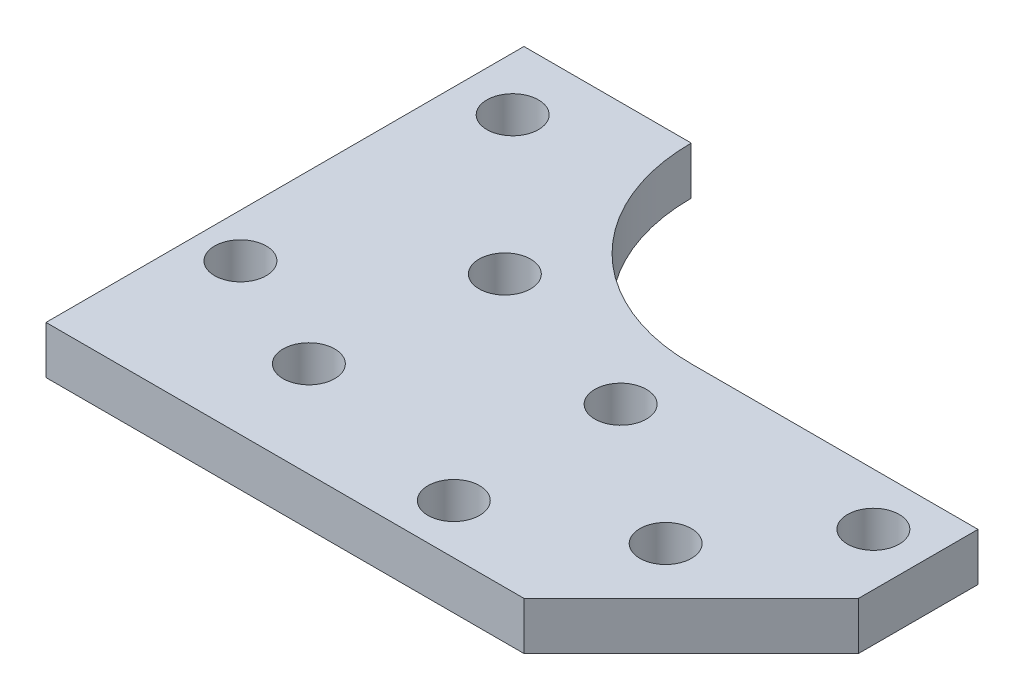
ISO-10303-21;
HEADER;
FILE_DESCRIPTION(('STEP AP214'),'2;1');
FILE_NAME('part.step','',(''),(''),'','','');
FILE_SCHEMA(('AUTOMOTIVE_DESIGN { 1 0 10303 214 1 1 1 1 }'));
ENDSEC;
DATA;
#1=APPLICATION_CONTEXT('core data for automotive mechanical design processes');
#2=APPLICATION_PROTOCOL_DEFINITION('international standard','automotive_design',2000,#1);
#3=PRODUCT_CONTEXT('',#1,'mechanical');
#4=PRODUCT('Part','Part','',(#3));
#5=PRODUCT_RELATED_PRODUCT_CATEGORY('part','',(#4));
#6=PRODUCT_DEFINITION_FORMATION('','',#4);
#7=PRODUCT_DEFINITION_CONTEXT('part definition',#1,'design');
#8=PRODUCT_DEFINITION('design','',#6,#7);
#9=PRODUCT_DEFINITION_SHAPE('','',#8);
#10=(LENGTH_UNIT() NAMED_UNIT(*) SI_UNIT(.MILLI.,.METRE.));
#11=(NAMED_UNIT(*) PLANE_ANGLE_UNIT() SI_UNIT($,.RADIAN.));
#12=(NAMED_UNIT(*) SI_UNIT($,.STERADIAN.) SOLID_ANGLE_UNIT());
#13=UNCERTAINTY_MEASURE_WITH_UNIT(LENGTH_MEASURE(1.E-05),#10,'distance_accuracy_value','');
#14=(GEOMETRIC_REPRESENTATION_CONTEXT(3) GLOBAL_UNCERTAINTY_ASSIGNED_CONTEXT((#13)) GLOBAL_UNIT_ASSIGNED_CONTEXT((#10,
#11,#12)) REPRESENTATION_CONTEXT('',''));
#15=CARTESIAN_POINT('',(0.,0.,0.));
#16=DIRECTION('',(0.,0.,1.));
#17=DIRECTION('',(1.,0.,0.));
#18=AXIS2_PLACEMENT_3D('',#15,#16,#17);
#19=CARTESIAN_POINT('',(75.,0.,-100.));
#20=DIRECTION('',(0.,-1.,0.));
#21=DIRECTION('',(0.,0.,-1.));
#22=AXIS2_PLACEMENT_3D('',#19,#20,#21);
#23=PLANE('',#22);
#24=CARTESIAN_POINT('',(11.1915887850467,0.,-86.4485981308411));
#25=DIRECTION('',(0.,1.,0.));
#26=DIRECTION('',(0.,0.,1.));
#27=AXIS2_PLACEMENT_3D('',#24,#25,#26);
#28=CIRCLE('',#27,5.39999999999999);
#29=CARTESIAN_POINT('',(11.1915887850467,0.,-81.0485981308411));
#30=VERTEX_POINT('',#29);
#31=EDGE_CURVE('E226',#30,#30,#28,.T.);
#32=ORIENTED_EDGE('',*,*,#31,.T.);
#33=EDGE_LOOP('',(#32));
#34=FACE_BOUND('',#33,.T.);
#35=CARTESIAN_POINT('',(104.883177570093,0.,-24.766355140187));
#36=DIRECTION('',(0.,1.,0.));
#37=DIRECTION('',(0.,0.,1.));
#38=AXIS2_PLACEMENT_3D('',#35,#36,#37);
#39=CIRCLE('',#38,5.39999999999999);
#40=CARTESIAN_POINT('',(104.883177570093,0.,-19.366355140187));
#41=VERTEX_POINT('',#40);
#42=EDGE_CURVE('E240',#41,#41,#39,.T.);
#43=ORIENTED_EDGE('',*,*,#42,.T.);
#44=EDGE_LOOP('',(#43));
#45=FACE_BOUND('',#44,.T.);
#46=CARTESIAN_POINT('',(74.9366219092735,0.,-10.3861239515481));
#47=DIRECTION('',(0.,1.,0.));
#48=DIRECTION('',(0.,0.,1.));
#49=AXIS2_PLACEMENT_3D('',#46,#47,#48);
#50=CIRCLE('',#49,5.39999999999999);
#51=CARTESIAN_POINT('',(74.9366219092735,0.,-4.98612395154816));
#52=VERTEX_POINT('',#51);
#53=EDGE_CURVE('E252',#52,#52,#50,.T.);
#54=ORIENTED_EDGE('',*,*,#53,.T.);
#55=EDGE_LOOP('',(#54));
#56=FACE_BOUND('',#55,.T.);
#57=CARTESIAN_POINT('',(35.,0.,-20.));
#58=DIRECTION('',(0.,1.,0.));
#59=DIRECTION('',(0.,0.,1.));
#60=AXIS2_PLACEMENT_3D('',#57,#58,#59);
#61=CIRCLE('',#60,5.39999999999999);
#62=CARTESIAN_POINT('',(35.,0.,-14.6));
#63=VERTEX_POINT('',#62);
#64=EDGE_CURVE('E113',#63,#63,#61,.T.);
#65=ORIENTED_EDGE('',*,*,#64,.T.);
#66=EDGE_LOOP('',(#65));
#67=FACE_BOUND('',#66,.T.);
#68=DIRECTION('',(0.,0.,1.));
#69=VECTOR('',#68,1.);
#70=CARTESIAN_POINT('',(0.,0.,-100.));
#71=LINE('',#70,#69);
#72=CARTESIAN_POINT('',(0.,0.,-100.));
#73=VERTEX_POINT('',#72);
#74=CARTESIAN_POINT('',(0.,0.,0.));
#75=VERTEX_POINT('',#74);
#76=EDGE_CURVE('E96',#73,#75,#71,.T.);
#77=ORIENTED_EDGE('',*,*,#76,.F.);
#78=DIRECTION('',(-1.,0.,0.));
#79=VECTOR('',#78,1.);
#80=CARTESIAN_POINT('',(35.,0.,-100.));
#81=LINE('',#80,#79);
#82=CARTESIAN_POINT('',(35.,0.,-100.));
#83=VERTEX_POINT('',#82);
#84=EDGE_CURVE('E124',#83,#73,#81,.T.);
#85=ORIENTED_EDGE('',*,*,#84,.F.);
#86=CARTESIAN_POINT('',(75.,0.,-100.));
#87=DIRECTION('',(0.,-1.,0.));
#88=DIRECTION('',(0.,0.,-1.));
#89=AXIS2_PLACEMENT_3D('',#86,#87,#88);
#90=CIRCLE('',#89,40.);
#91=CARTESIAN_POINT('',(75.,0.,-60.));
#92=VERTEX_POINT('',#91);
#93=EDGE_CURVE('E122',#92,#83,#90,.T.);
#94=ORIENTED_EDGE('',*,*,#93,.F.);
#95=DIRECTION('',(-1.,0.,0.));
#96=VECTOR('',#95,1.);
#97=CARTESIAN_POINT('',(135.,0.,-60.));
#98=LINE('',#97,#96);
#99=CARTESIAN_POINT('',(135.,0.,-60.));
#100=VERTEX_POINT('',#99);
#101=EDGE_CURVE('E120',#100,#92,#98,.T.);
#102=ORIENTED_EDGE('',*,*,#101,.F.);
#103=DIRECTION('',(0.,0.,-1.));
#104=VECTOR('',#103,1.);
#105=CARTESIAN_POINT('',(135.,0.,-35.));
#106=LINE('',#105,#104);
#107=CARTESIAN_POINT('',(135.,0.,-35.));
#108=VERTEX_POINT('',#107);
#109=EDGE_CURVE('E118',#108,#100,#106,.T.);
#110=ORIENTED_EDGE('',*,*,#109,.F.);
#111=DIRECTION('',(0.707106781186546,0.,-0.707106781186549));
#112=VECTOR('',#111,1.);
#113=CARTESIAN_POINT('',(100.,0.,0.));
#114=LINE('',#113,#112);
#115=CARTESIAN_POINT('',(100.,0.,0.));
#116=VERTEX_POINT('',#115);
#117=EDGE_CURVE('E98',#116,#108,#114,.T.);
#118=ORIENTED_EDGE('',*,*,#117,.F.);
#119=DIRECTION('',(1.,0.,0.));
#120=VECTOR('',#119,1.);
#121=CARTESIAN_POINT('',(0.,0.,0.));
#122=LINE('',#121,#120);
#123=EDGE_CURVE('E92',#75,#116,#122,.T.);
#124=ORIENTED_EDGE('',*,*,#123,.F.);
#125=EDGE_LOOP('',(#77,#85,#94,#102,#110,#118,#124));
#126=FACE_BOUND('',#125,.T.);
#127=CARTESIAN_POINT('',(9.1822429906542,0.,-31.4953271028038));
#128=DIRECTION('',(0.,1.,0.));
#129=DIRECTION('',(0.,0.,1.));
#130=AXIS2_PLACEMENT_3D('',#127,#128,#129);
#131=CIRCLE('',#130,5.39999999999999);
#132=CARTESIAN_POINT('',(9.1822429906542,0.,-26.0953271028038));
#133=VERTEX_POINT('',#132);
#134=EDGE_CURVE('E258',#133,#133,#131,.T.);
#135=ORIENTED_EDGE('',*,*,#134,.T.);
#136=EDGE_LOOP('',(#135));
#137=FACE_BOUND('',#136,.T.);
#138=CARTESIAN_POINT('',(39.2289719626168,0.,-56.7757009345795));
#139=DIRECTION('',(0.,1.,0.));
#140=DIRECTION('',(0.,0.,1.));
#141=AXIS2_PLACEMENT_3D('',#138,#139,#140);
#142=CIRCLE('',#141,5.39999999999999);
#143=CARTESIAN_POINT('',(39.2289719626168,0.,-51.3757009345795));
#144=VERTEX_POINT('',#143);
#145=EDGE_CURVE('E246',#144,#144,#142,.T.);
#146=ORIENTED_EDGE('',*,*,#145,.T.);
#147=EDGE_LOOP('',(#146));
#148=FACE_BOUND('',#147,.T.);
#149=CARTESIAN_POINT('',(124.042056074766,0.,-49.0654205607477));
#150=DIRECTION('',(0.,1.,0.));
#151=DIRECTION('',(0.,0.,1.));
#152=AXIS2_PLACEMENT_3D('',#149,#150,#151);
#153=CIRCLE('',#152,5.39999999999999);
#154=CARTESIAN_POINT('',(124.042056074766,0.,-43.6654205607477));
#155=VERTEX_POINT('',#154);
#156=EDGE_CURVE('E234',#155,#155,#153,.T.);
#157=ORIENTED_EDGE('',*,*,#156,.T.);
#158=EDGE_LOOP('',(#157));
#159=FACE_BOUND('',#158,.T.);
#160=CARTESIAN_POINT('',(74.9366219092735,0.,-45.2921588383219));
#161=DIRECTION('',(0.,1.,0.));
#162=DIRECTION('',(0.,0.,1.));
#163=AXIS2_PLACEMENT_3D('',#160,#161,#162);
#164=CIRCLE('',#163,5.39999999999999);
#165=CARTESIAN_POINT('',(74.9366219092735,0.,-39.8921588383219));
#166=VERTEX_POINT('',#165);
#167=EDGE_CURVE('E222',#166,#166,#164,.T.);
#168=ORIENTED_EDGE('',*,*,#167,.T.);
#169=EDGE_LOOP('',(#168));
#170=FACE_BOUND('',#169,.T.);
#171=ADVANCED_FACE('F33',(#34,#45,#56,#67,#126,#137,#148,#159,#170),#23,.T.);
#172=CARTESIAN_POINT('',(0.,10.,-100.));
#173=DIRECTION('',(1.,0.,0.));
#174=DIRECTION('',(0.,0.,-1.));
#175=AXIS2_PLACEMENT_3D('',#172,#173,#174);
#176=PLANE('',#175);
#177=ORIENTED_EDGE('',*,*,#76,.T.);
#178=DIRECTION('',(0.,-1.,0.));
#179=VECTOR('',#178,1.);
#180=CARTESIAN_POINT('',(0.,10.,0.));
#181=LINE('',#180,#179);
#182=CARTESIAN_POINT('',(0.,10.,0.));
#183=VERTEX_POINT('',#182);
#184=EDGE_CURVE('E11',#183,#75,#181,.T.);
#185=ORIENTED_EDGE('',*,*,#184,.F.);
#186=DIRECTION('',(0.,0.,1.));
#187=VECTOR('',#186,1.);
#188=CARTESIAN_POINT('',(0.,10.,-100.));
#189=LINE('',#188,#187);
#190=CARTESIAN_POINT('',(0.,10.,-100.));
#191=VERTEX_POINT('',#190);
#192=EDGE_CURVE('E126',#191,#183,#189,.T.);
#193=ORIENTED_EDGE('',*,*,#192,.F.);
#194=DIRECTION('',(0.,-1.,0.));
#195=VECTOR('',#194,1.);
#196=CARTESIAN_POINT('',(0.,10.,-100.));
#197=LINE('',#196,#195);
#198=EDGE_CURVE('E109',#191,#73,#197,.T.);
#199=ORIENTED_EDGE('',*,*,#198,.T.);
#200=EDGE_LOOP('',(#177,#185,#193,#199));
#201=FACE_BOUND('',#200,.T.);
#202=ADVANCED_FACE('F35',(#201),#176,.F.);
#203=CARTESIAN_POINT('',(0.,10.,0.));
#204=DIRECTION('',(0.,0.,-1.));
#205=DIRECTION('',(-1.,0.,0.));
#206=AXIS2_PLACEMENT_3D('',#203,#204,#205);
#207=PLANE('',#206);
#208=ORIENTED_EDGE('',*,*,#123,.T.);
#209=DIRECTION('',(0.,-1.,0.));
#210=VECTOR('',#209,1.);
#211=CARTESIAN_POINT('',(100.,10.,0.));
#212=LINE('',#211,#210);
#213=CARTESIAN_POINT('',(100.,10.,0.));
#214=VERTEX_POINT('',#213);
#215=EDGE_CURVE('E41',#214,#116,#212,.T.);
#216=ORIENTED_EDGE('',*,*,#215,.F.);
#217=DIRECTION('',(1.,0.,0.));
#218=VECTOR('',#217,1.);
#219=CARTESIAN_POINT('',(0.,10.,0.));
#220=LINE('',#219,#218);
#221=EDGE_CURVE('E105',#183,#214,#220,.T.);
#222=ORIENTED_EDGE('',*,*,#221,.F.);
#223=ORIENTED_EDGE('',*,*,#184,.T.);
#224=EDGE_LOOP('',(#208,#216,#222,#223));
#225=FACE_BOUND('',#224,.T.);
#226=ADVANCED_FACE('F104',(#225),#207,.F.);
#227=CARTESIAN_POINT('',(100.,10.,0.));
#228=DIRECTION('',(-0.707106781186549,0.,-0.707106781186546));
#229=DIRECTION('',(-0.707106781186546,0.,0.707106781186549));
#230=AXIS2_PLACEMENT_3D('',#227,#228,#229);
#231=PLANE('',#230);
#232=ORIENTED_EDGE('',*,*,#117,.T.);
#233=DIRECTION('',(0.,-1.,0.));
#234=VECTOR('',#233,1.);
#235=CARTESIAN_POINT('',(135.,10.,-35.));
#236=LINE('',#235,#234);
#237=CARTESIAN_POINT('',(135.,10.,-35.));
#238=VERTEX_POINT('',#237);
#239=EDGE_CURVE('E147',#238,#108,#236,.T.);
#240=ORIENTED_EDGE('',*,*,#239,.F.);
#241=DIRECTION('',(0.707106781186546,0.,-0.707106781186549));
#242=VECTOR('',#241,1.);
#243=CARTESIAN_POINT('',(100.,10.,0.));
#244=LINE('',#243,#242);
#245=EDGE_CURVE('E129',#214,#238,#244,.T.);
#246=ORIENTED_EDGE('',*,*,#245,.F.);
#247=ORIENTED_EDGE('',*,*,#215,.T.);
#248=EDGE_LOOP('',(#232,#240,#246,#247));
#249=FACE_BOUND('',#248,.T.);
#250=ADVANCED_FACE('F151',(#249),#231,.F.);
#251=CARTESIAN_POINT('',(135.,10.,-35.));
#252=DIRECTION('',(-1.,0.,0.));
#253=DIRECTION('',(0.,0.,1.));
#254=AXIS2_PLACEMENT_3D('',#251,#252,#253);
#255=PLANE('',#254);
#256=ORIENTED_EDGE('',*,*,#109,.T.);
#257=DIRECTION('',(0.,-1.,0.));
#258=VECTOR('',#257,1.);
#259=CARTESIAN_POINT('',(135.,10.,-60.));
#260=LINE('',#259,#258);
#261=CARTESIAN_POINT('',(135.,10.,-60.));
#262=VERTEX_POINT('',#261);
#263=EDGE_CURVE('E144',#262,#100,#260,.T.);
#264=ORIENTED_EDGE('',*,*,#263,.F.);
#265=DIRECTION('',(0.,0.,-1.));
#266=VECTOR('',#265,1.);
#267=CARTESIAN_POINT('',(135.,10.,-35.));
#268=LINE('',#267,#266);
#269=EDGE_CURVE('E131',#238,#262,#268,.T.);
#270=ORIENTED_EDGE('',*,*,#269,.F.);
#271=ORIENTED_EDGE('',*,*,#239,.T.);
#272=EDGE_LOOP('',(#256,#264,#270,#271));
#273=FACE_BOUND('',#272,.T.);
#274=ADVANCED_FACE('F159',(#273),#255,.F.);
#275=CARTESIAN_POINT('',(135.,10.,-60.));
#276=DIRECTION('',(0.,0.,1.));
#277=DIRECTION('',(1.,0.,0.));
#278=AXIS2_PLACEMENT_3D('',#275,#276,#277);
#279=PLANE('',#278);
#280=ORIENTED_EDGE('',*,*,#101,.T.);
#281=DIRECTION('',(0.,-1.,0.));
#282=VECTOR('',#281,1.);
#283=CARTESIAN_POINT('',(75.,10.,-60.));
#284=LINE('',#283,#282);
#285=CARTESIAN_POINT('',(75.,10.,-60.));
#286=VERTEX_POINT('',#285);
#287=EDGE_CURVE('E141',#286,#92,#284,.T.);
#288=ORIENTED_EDGE('',*,*,#287,.F.);
#289=DIRECTION('',(-1.,0.,0.));
#290=VECTOR('',#289,1.);
#291=CARTESIAN_POINT('',(135.,10.,-60.));
#292=LINE('',#291,#290);
#293=EDGE_CURVE('E133',#262,#286,#292,.T.);
#294=ORIENTED_EDGE('',*,*,#293,.F.);
#295=ORIENTED_EDGE('',*,*,#263,.T.);
#296=EDGE_LOOP('',(#280,#288,#294,#295));
#297=FACE_BOUND('',#296,.T.);
#298=ADVANCED_FACE('F162',(#297),#279,.F.);
#299=CARTESIAN_POINT('',(75.,10.,-100.));
#300=DIRECTION('',(0.,-1.,0.));
#301=DIRECTION('',(0.,0.,-1.));
#302=AXIS2_PLACEMENT_3D('',#299,#300,#301);
#303=CYLINDRICAL_SURFACE('',#302,40.);
#304=ORIENTED_EDGE('',*,*,#93,.T.);
#305=DIRECTION('',(0.,-1.,0.));
#306=VECTOR('',#305,1.);
#307=CARTESIAN_POINT('',(35.,10.,-100.));
#308=LINE('',#307,#306);
#309=CARTESIAN_POINT('',(35.,10.,-100.));
#310=VERTEX_POINT('',#309);
#311=EDGE_CURVE('E138',#310,#83,#308,.T.);
#312=ORIENTED_EDGE('',*,*,#311,.F.);
#313=CARTESIAN_POINT('',(75.,10.,-100.));
#314=DIRECTION('',(0.,-1.,0.));
#315=DIRECTION('',(0.,0.,-1.));
#316=AXIS2_PLACEMENT_3D('',#313,#314,#315);
#317=CIRCLE('',#316,40.);
#318=EDGE_CURVE('E53',#286,#310,#317,.T.);
#319=ORIENTED_EDGE('',*,*,#318,.F.);
#320=ORIENTED_EDGE('',*,*,#287,.T.);
#321=EDGE_LOOP('',(#304,#312,#319,#320));
#322=FACE_BOUND('',#321,.T.);
#323=ADVANCED_FACE('F165',(#322),#303,.F.);
#324=CARTESIAN_POINT('',(35.,10.,-100.));
#325=DIRECTION('',(0.,0.,1.));
#326=DIRECTION('',(1.,0.,0.));
#327=AXIS2_PLACEMENT_3D('',#324,#325,#326);
#328=PLANE('',#327);
#329=ORIENTED_EDGE('',*,*,#84,.T.);
#330=ORIENTED_EDGE('',*,*,#198,.F.);
#331=DIRECTION('',(-1.,0.,0.));
#332=VECTOR('',#331,1.);
#333=CARTESIAN_POINT('',(35.,10.,-100.));
#334=LINE('',#333,#332);
#335=EDGE_CURVE('E48',#310,#191,#334,.T.);
#336=ORIENTED_EDGE('',*,*,#335,.F.);
#337=ORIENTED_EDGE('',*,*,#311,.T.);
#338=EDGE_LOOP('',(#329,#330,#336,#337));
#339=FACE_BOUND('',#338,.T.);
#340=ADVANCED_FACE('F167',(#339),#328,.F.);
#341=CARTESIAN_POINT('',(75.,10.,-100.));
#342=DIRECTION('',(0.,-1.,0.));
#343=DIRECTION('',(0.,0.,-1.));
#344=AXIS2_PLACEMENT_3D('',#341,#342,#343);
#345=PLANE('',#344);
#346=CARTESIAN_POINT('',(74.9366219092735,10.,-45.2921588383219));
#347=DIRECTION('',(0.,1.,0.));
#348=DIRECTION('',(0.,0.,1.));
#349=AXIS2_PLACEMENT_3D('',#346,#347,#348);
#350=CIRCLE('',#349,5.39999999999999);
#351=CARTESIAN_POINT('',(74.9366219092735,10.,-39.8921588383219));
#352=VERTEX_POINT('',#351);
#353=EDGE_CURVE('E225',#352,#352,#350,.T.);
#354=ORIENTED_EDGE('',*,*,#353,.F.);
#355=EDGE_LOOP('',(#354));
#356=FACE_BOUND('',#355,.T.);
#357=CARTESIAN_POINT('',(11.1915887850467,10.,-86.4485981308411));
#358=DIRECTION('',(0.,1.,0.));
#359=DIRECTION('',(0.,0.,1.));
#360=AXIS2_PLACEMENT_3D('',#357,#358,#359);
#361=CIRCLE('',#360,5.39999999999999);
#362=CARTESIAN_POINT('',(11.1915887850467,10.,-81.0485981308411));
#363=VERTEX_POINT('',#362);
#364=EDGE_CURVE('E228',#363,#363,#361,.T.);
#365=ORIENTED_EDGE('',*,*,#364,.F.);
#366=EDGE_LOOP('',(#365));
#367=FACE_BOUND('',#366,.T.);
#368=CARTESIAN_POINT('',(124.042056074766,10.,-49.0654205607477));
#369=DIRECTION('',(0.,1.,0.));
#370=DIRECTION('',(0.,0.,1.));
#371=AXIS2_PLACEMENT_3D('',#368,#369,#370);
#372=CIRCLE('',#371,5.39999999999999);
#373=CARTESIAN_POINT('',(124.042056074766,10.,-43.6654205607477));
#374=VERTEX_POINT('',#373);
#375=EDGE_CURVE('E237',#374,#374,#372,.T.);
#376=ORIENTED_EDGE('',*,*,#375,.F.);
#377=EDGE_LOOP('',(#376));
#378=FACE_BOUND('',#377,.T.);
#379=CARTESIAN_POINT('',(104.883177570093,10.,-24.766355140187));
#380=DIRECTION('',(0.,1.,0.));
#381=DIRECTION('',(0.,0.,1.));
#382=AXIS2_PLACEMENT_3D('',#379,#380,#381);
#383=CIRCLE('',#382,5.39999999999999);
#384=CARTESIAN_POINT('',(104.883177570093,10.,-19.366355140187));
#385=VERTEX_POINT('',#384);
#386=EDGE_CURVE('E243',#385,#385,#383,.T.);
#387=ORIENTED_EDGE('',*,*,#386,.F.);
#388=EDGE_LOOP('',(#387));
#389=FACE_BOUND('',#388,.T.);
#390=CARTESIAN_POINT('',(39.2289719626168,10.,-56.7757009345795));
#391=DIRECTION('',(0.,1.,0.));
#392=DIRECTION('',(0.,0.,1.));
#393=AXIS2_PLACEMENT_3D('',#390,#391,#392);
#394=CIRCLE('',#393,5.39999999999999);
#395=CARTESIAN_POINT('',(39.2289719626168,10.,-51.3757009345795));
#396=VERTEX_POINT('',#395);
#397=EDGE_CURVE('E249',#396,#396,#394,.T.);
#398=ORIENTED_EDGE('',*,*,#397,.F.);
#399=EDGE_LOOP('',(#398));
#400=FACE_BOUND('',#399,.T.);
#401=CARTESIAN_POINT('',(74.9366219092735,10.,-10.3861239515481));
#402=DIRECTION('',(0.,1.,0.));
#403=DIRECTION('',(0.,0.,1.));
#404=AXIS2_PLACEMENT_3D('',#401,#402,#403);
#405=CIRCLE('',#404,5.39999999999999);
#406=CARTESIAN_POINT('',(74.9366219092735,10.,-4.98612395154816));
#407=VERTEX_POINT('',#406);
#408=EDGE_CURVE('E255',#407,#407,#405,.T.);
#409=ORIENTED_EDGE('',*,*,#408,.F.);
#410=EDGE_LOOP('',(#409));
#411=FACE_BOUND('',#410,.T.);
#412=CARTESIAN_POINT('',(9.1822429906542,10.,-31.4953271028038));
#413=DIRECTION('',(0.,1.,0.));
#414=DIRECTION('',(0.,0.,1.));
#415=AXIS2_PLACEMENT_3D('',#412,#413,#414);
#416=CIRCLE('',#415,5.39999999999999);
#417=CARTESIAN_POINT('',(9.1822429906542,10.,-26.0953271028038));
#418=VERTEX_POINT('',#417);
#419=EDGE_CURVE('E261',#418,#418,#416,.T.);
#420=ORIENTED_EDGE('',*,*,#419,.F.);
#421=EDGE_LOOP('',(#420));
#422=FACE_BOUND('',#421,.T.);
#423=CARTESIAN_POINT('',(35.,10.,-20.));
#424=DIRECTION('',(0.,1.,0.));
#425=DIRECTION('',(0.,0.,1.));
#426=AXIS2_PLACEMENT_3D('',#423,#424,#425);
#427=CIRCLE('',#426,5.39999999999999);
#428=CARTESIAN_POINT('',(35.,10.,-14.6));
#429=VERTEX_POINT('',#428);
#430=EDGE_CURVE('E110',#429,#429,#427,.T.);
#431=ORIENTED_EDGE('',*,*,#430,.F.);
#432=EDGE_LOOP('',(#431));
#433=FACE_BOUND('',#432,.T.);
#434=ORIENTED_EDGE('',*,*,#192,.T.);
#435=ORIENTED_EDGE('',*,*,#221,.T.);
#436=ORIENTED_EDGE('',*,*,#245,.T.);
#437=ORIENTED_EDGE('',*,*,#269,.T.);
#438=ORIENTED_EDGE('',*,*,#293,.T.);
#439=ORIENTED_EDGE('',*,*,#318,.T.);
#440=ORIENTED_EDGE('',*,*,#335,.T.);
#441=EDGE_LOOP('',(#434,#435,#436,#437,#438,#439,#440));
#442=FACE_BOUND('',#441,.T.);
#443=ADVANCED_FACE('F154',(#356,#367,#378,#389,#400,#411,#422,#433,#442),#345,.F.);
#444=CARTESIAN_POINT('',(35.,10.,-20.));
#445=DIRECTION('',(0.,1.,0.));
#446=DIRECTION('',(0.,0.,1.));
#447=AXIS2_PLACEMENT_3D('',#444,#445,#446);
#448=CYLINDRICAL_SURFACE('',#447,5.39999999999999);
#449=ORIENTED_EDGE('',*,*,#64,.F.);
#450=EDGE_LOOP('',(#449));
#451=FACE_BOUND('',#450,.T.);
#452=ORIENTED_EDGE('',*,*,#430,.T.);
#453=EDGE_LOOP('',(#452));
#454=FACE_BOUND('',#453,.T.);
#455=ADVANCED_FACE('F174',(#451,#454),#448,.F.);
#456=CARTESIAN_POINT('',(9.1822429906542,10.,-31.4953271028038));
#457=DIRECTION('',(0.,1.,0.));
#458=DIRECTION('',(0.,0.,1.));
#459=AXIS2_PLACEMENT_3D('',#456,#457,#458);
#460=CYLINDRICAL_SURFACE('',#459,5.39999999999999);
#461=ORIENTED_EDGE('',*,*,#134,.F.);
#462=EDGE_LOOP('',(#461));
#463=FACE_BOUND('',#462,.T.);
#464=ORIENTED_EDGE('',*,*,#419,.T.);
#465=EDGE_LOOP('',(#464));
#466=FACE_BOUND('',#465,.T.);
#467=ADVANCED_FACE('F189',(#463,#466),#460,.F.);
#468=CARTESIAN_POINT('',(74.9366219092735,10.,-10.3861239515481));
#469=DIRECTION('',(0.,1.,0.));
#470=DIRECTION('',(0.,0.,1.));
#471=AXIS2_PLACEMENT_3D('',#468,#469,#470);
#472=CYLINDRICAL_SURFACE('',#471,5.39999999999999);
#473=ORIENTED_EDGE('',*,*,#53,.F.);
#474=EDGE_LOOP('',(#473));
#475=FACE_BOUND('',#474,.T.);
#476=ORIENTED_EDGE('',*,*,#408,.T.);
#477=EDGE_LOOP('',(#476));
#478=FACE_BOUND('',#477,.T.);
#479=ADVANCED_FACE('F193',(#475,#478),#472,.F.);
#480=CARTESIAN_POINT('',(39.2289719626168,10.,-56.7757009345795));
#481=DIRECTION('',(0.,1.,0.));
#482=DIRECTION('',(0.,0.,1.));
#483=AXIS2_PLACEMENT_3D('',#480,#481,#482);
#484=CYLINDRICAL_SURFACE('',#483,5.39999999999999);
#485=ORIENTED_EDGE('',*,*,#145,.F.);
#486=EDGE_LOOP('',(#485));
#487=FACE_BOUND('',#486,.T.);
#488=ORIENTED_EDGE('',*,*,#397,.T.);
#489=EDGE_LOOP('',(#488));
#490=FACE_BOUND('',#489,.T.);
#491=ADVANCED_FACE('F197',(#487,#490),#484,.F.);
#492=CARTESIAN_POINT('',(104.883177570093,10.,-24.766355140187));
#493=DIRECTION('',(0.,1.,0.));
#494=DIRECTION('',(0.,0.,1.));
#495=AXIS2_PLACEMENT_3D('',#492,#493,#494);
#496=CYLINDRICAL_SURFACE('',#495,5.39999999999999);
#497=ORIENTED_EDGE('',*,*,#42,.F.);
#498=EDGE_LOOP('',(#497));
#499=FACE_BOUND('',#498,.T.);
#500=ORIENTED_EDGE('',*,*,#386,.T.);
#501=EDGE_LOOP('',(#500));
#502=FACE_BOUND('',#501,.T.);
#503=ADVANCED_FACE('F201',(#499,#502),#496,.F.);
#504=CARTESIAN_POINT('',(124.042056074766,10.,-49.0654205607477));
#505=DIRECTION('',(0.,1.,0.));
#506=DIRECTION('',(0.,0.,1.));
#507=AXIS2_PLACEMENT_3D('',#504,#505,#506);
#508=CYLINDRICAL_SURFACE('',#507,5.39999999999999);
#509=ORIENTED_EDGE('',*,*,#156,.F.);
#510=EDGE_LOOP('',(#509));
#511=FACE_BOUND('',#510,.T.);
#512=ORIENTED_EDGE('',*,*,#375,.T.);
#513=EDGE_LOOP('',(#512));
#514=FACE_BOUND('',#513,.T.);
#515=ADVANCED_FACE('F205',(#511,#514),#508,.F.);
#516=CARTESIAN_POINT('',(11.1915887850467,10.,-86.4485981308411));
#517=DIRECTION('',(0.,1.,0.));
#518=DIRECTION('',(0.,0.,1.));
#519=AXIS2_PLACEMENT_3D('',#516,#517,#518);
#520=CYLINDRICAL_SURFACE('',#519,5.39999999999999);
#521=ORIENTED_EDGE('',*,*,#31,.F.);
#522=EDGE_LOOP('',(#521));
#523=FACE_BOUND('',#522,.T.);
#524=ORIENTED_EDGE('',*,*,#364,.T.);
#525=EDGE_LOOP('',(#524));
#526=FACE_BOUND('',#525,.T.);
#527=ADVANCED_FACE('F209',(#523,#526),#520,.F.);
#528=CARTESIAN_POINT('',(74.9366219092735,10.,-45.2921588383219));
#529=DIRECTION('',(0.,1.,0.));
#530=DIRECTION('',(0.,0.,1.));
#531=AXIS2_PLACEMENT_3D('',#528,#529,#530);
#532=CYLINDRICAL_SURFACE('',#531,5.39999999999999);
#533=ORIENTED_EDGE('',*,*,#167,.F.);
#534=EDGE_LOOP('',(#533));
#535=FACE_BOUND('',#534,.T.);
#536=ORIENTED_EDGE('',*,*,#353,.T.);
#537=EDGE_LOOP('',(#536));
#538=FACE_BOUND('',#537,.T.);
#539=ADVANCED_FACE('F213',(#535,#538),#532,.F.);
#540=CLOSED_SHELL('',(#171,#202,#226,#250,#274,#298,#323,#340,#443,#455,#467,#479,#491,#503,
#515,#527,#539));
#541=MANIFOLD_SOLID_BREP('B2',#540);
#542=ADVANCED_BREP_SHAPE_REPRESENTATION('',(#18,#541),#14);
#543=SHAPE_DEFINITION_REPRESENTATION(#9,#542);
ENDSEC;
END-ISO-10303-21;
